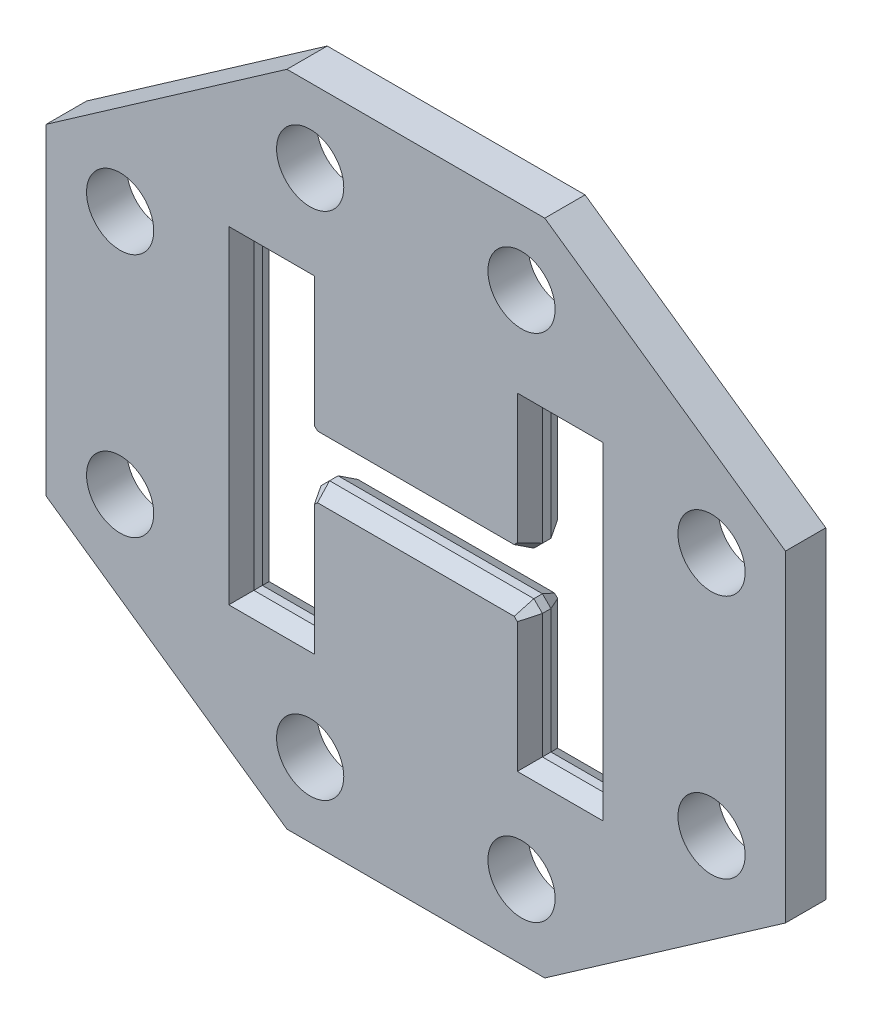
from build123d import *

# Parameters (mm, degrees)
MAIN_PLATE_DEPTH   = 28.575
SKETCH7_W          = 497.538687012
SKETCH7_H          = 609.547031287
EXTRUDE_W500_DEPTH = 28.575
HOLES_DEPTH        = 702.925349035
HOLES_DEPTH_BACK   = 702.925349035
SKETCH5_R          = 47.625
CHAMFER1_SIZE      = 13
CHAMFER1_SIZE2     = 22.516660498
CHAMFER2_SIZE      = 13
CHAMFER2_SIZE2     = 22.516660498


with BuildPart() as part:
    # Sketch3 → Main Plate (new, symmetric)
    with BuildSketch(Plane(origin=(0, 0, 0), x_dir=(0, 1, 0), z_dir=(0, 0, 1))):
        Polygon((228.234235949, 523.855268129), (466.324268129, 182.70492307), (466.324268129, -182.70492307), (228.234235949, -523.855268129), (-228.234235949, -523.855268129), (-466.324268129, -182.70492307), (-466.324268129, 182.70492307), (-228.234235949, 523.855268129), align=None)
        Polygon((-54.229, 156.845), (-230.378, 156.845), (-230.378, 287.909), (230.378, 287.909), (230.378, 156.845), (54.229, 156.845), (42.164, 144.78), (42.164, -144.78), (54.229, -156.845), (230.378, -156.845), (230.378, -287.909), (-230.378, -287.909), (-230.378, -156.845), (-54.229, -156.845), (-42.164, -144.78), (-42.164, 144.78), align=None, mode=Mode.SUBTRACT)
    extrude(amount=MAIN_PLATE_DEPTH, both=True)

    # Sketch7 → Extrude w500 (add, symmetric)
    with BuildSketch(Plane(origin=(0, 0, 0), x_dir=(0, 1, 0), z_dir=(0, 0, 1))):
        with Locations((1.117579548, 1.02218148)):
            Rectangle(SKETCH7_W, SKETCH7_H)
        Polygon((30.988, 144.78), (30.988, -144.78), (43.053, -156.845), (219.202, -156.845), (219.202, -252.095), (-219.202, -252.095), (-219.202, -156.845), (-43.053, -156.845), (-30.988, -144.78), (-30.988, 144.78), (-43.053, 156.845), (-219.202, 156.845), (-219.202, 252.095), (219.202, 252.095), (219.202, 156.845), (43.053, 156.845), align=None, mode=Mode.SUBTRACT)
    extrude(amount=EXTRUDE_W500_DEPTH, both=True)

    # Sketch5 → holes (cut, two sides: drawn at the far end of the back side and taken through both)
    with BuildSketch(Plane(origin=(0, 0, 0), x_dir=(0, 1, 0), z_dir=(0, 0, 1)).offset(-HOLES_DEPTH_BACK)):
        with Locations(Location((-173.588730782, 419.080268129, 0), (0, 0, 270))):
            Circle(SKETCH5_R)
        with Locations(Location((173.588730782, 419.080268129, 0), (0, 0, 270))):
            Circle(SKETCH5_R)
        with Locations(Location((361.549268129, 149.758610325, 0), (0, 0, 270))):
            Circle(SKETCH5_R)
        with Locations(Location((361.549268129, -149.758610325, 0), (0, 0, 270))):
            Circle(SKETCH5_R)
        with Locations(Location((173.588730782, -419.080268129, 0), (0, 0, 270))):
            Circle(SKETCH5_R)
        with Locations(Location((-173.588730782, -419.080268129, 0), (0, 0, 270))):
            Circle(SKETCH5_R)
        with Locations(Location((-361.549268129, -149.758610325, 0), (0, 0, 270))):
            Circle(SKETCH5_R)
        with Locations(Location((-361.549268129, 149.758610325, 0), (0, 0, 270))):
            Circle(SKETCH5_R)
    extrude(amount=HOLES_DEPTH + HOLES_DEPTH_BACK, mode=Mode.SUBTRACT)

    # Chamfer1
    chamfer1_edges = [part.edges().sort_by_distance(p)[0] for p in [
        (-204.47, 219.202, 28.575),
        (-252.095, 0, 28.575),
        (-204.47, -219.202, 28.575),
        (-150.8125, -37.0205, 28.575),
        (0, -30.988, 28.575),
        (150.8125, -37.0205, 28.575),
        (204.47, -219.202, 28.575),
        (252.095, 0, 28.575),
        (204.47, 219.202, 28.575),
        (150.8125, 37.0205, 28.575),
        (0, 30.988, 28.575),
        (156.845, -131.1275, 28.575),
        (-156.845, 131.1275, 28.575),
        (-156.845, -131.1275, 28.575),
        (156.845, 131.1275, 28.575),
        (-150.8125, 37.0205, 28.575),
    ]]
    chamfer1_side = [part.faces().sort_by_distance(p)[0] for p in [
        (-345.252406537, 335.776675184, 28.575),
    ]]
    chamfer(chamfer1_edges, length=CHAMFER1_SIZE, length2=CHAMFER1_SIZE2, reference=chamfer1_side[0])

    # Chamfer2
    chamfer2_edges = [part.edges().sort_by_distance(p)[0] for p in [
        (156.845, -131.1275, -28.575),
        (-156.845, 131.1275, -28.575),
        (-156.845, -131.1275, -28.575),
        (156.845, 131.1275, -28.575),
        (150.8125, 37.0205, -28.575),
        (0, 30.988, -28.575),
        (-150.8125, 37.0205, -28.575),
        (204.47, -219.202, -28.575),
        (252.095, 0, -28.575),
        (204.47, 219.202, -28.575),
        (-204.47, 219.202, -28.575),
        (-252.095, 0, -28.575),
        (-204.47, -219.202, -28.575),
        (-150.8125, -37.0205, -28.575),
        (0, -30.988, -28.575),
        (150.8125, -37.0205, -28.575),
    ]]
    chamfer2_side = [part.faces().sort_by_distance(p)[0] for p in [
        (-345.252406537, 335.776675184, -28.575),
    ]]
    chamfer(chamfer2_edges, length=CHAMFER2_SIZE, length2=CHAMFER2_SIZE2, reference=chamfer2_side[0])


solid = part.part
